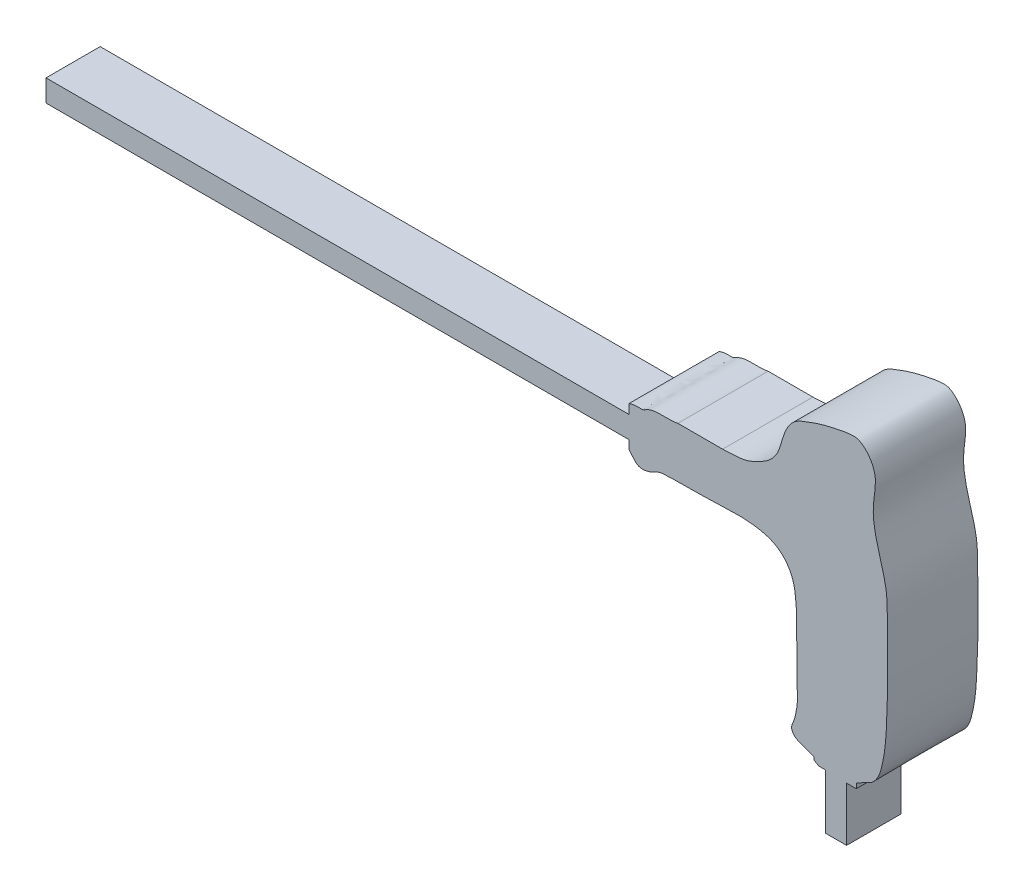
from build123d import *

# Parameters (mm, degrees)
BOSS_EXTRU_1_DEPTH      = 10
BOSS_EXTRU_1_DEPTH_BACK = 10
ESQUISSE2_W             = 4.650975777
ESQUISSE2_H             = 11.951241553
ESQUISSE2_W_2           = 129.179899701
ESQUISSE2_H_2           = 4.838027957
ENL_V_MAT_EXTRU_1_DEPTH = 8


with BuildPart() as part:
    # Esquisse1 → Boss.-Extru.1 (new, two sides: drawn at the far end of the back side and taken through both)
    with BuildSketch(Plane.XY.offset(-BOSS_EXTRU_1_DEPTH_BACK)):
        with BuildLine():
            Line((200.326850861, 127.469215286), (71.14695116, 127.469215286))
            Line((71.14695116, 127.469215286), (71.14695116, 122.631187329))
            Line((71.14695116, 122.631187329), (200.326850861, 122.631187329))
            Line((200.326850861, 122.631187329), (200.326850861, 120.780955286))
            add(Edge.make_bspline(
                [(200.326850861, 120.780955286), (200.976403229, 120.118576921), (201.790471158, 118.498355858), (203.57159299, 118.445839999), (204.776091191, 118.654219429), (205.922609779, 119.2122944), (207.448152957, 119.971812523), (208.767127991, 119.848146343), (209.962572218, 119.964572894), (211.057221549, 119.954960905), (213.076805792, 119.993248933), (215.82704311, 119.99950571), (218.903257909, 120.085876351), (221.801662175, 120.185317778), (224.392229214, 120.321512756), (226.841122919, 120.172470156), (229.371234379, 119.900831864), (231.753046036, 119.250177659), (234.550302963, 117.638497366), (236.538386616, 114.838754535), (237.427403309, 110.49328546), (237.477582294, 105.640384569), (237.490623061, 99.951484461), (237.541604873, 94.875564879), (237.752640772, 91.123889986), (237.332269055, 88.69612375), (236.973036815, 87.139785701), (236.375375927, 85.999935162), (236.316166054, 85.027639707), (237.00631938, 83.904164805), (238.872882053, 83.093864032), (240.433411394, 82.644375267), (241.362331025, 82.310713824)],
                knots=[0, 0, 0, 0, 0.041719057, 0.056995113, 0.067757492, 0.0907017, 0.10765282, 0.134914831, 0.141748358, 0.155798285, 0.178637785, 0.222641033, 0.265843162, 0.301798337, 0.33874171, 0.369558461, 0.399857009, 0.440590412, 0.467229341, 0.527997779, 0.570154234, 0.6434881, 0.721730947, 0.797897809, 0.84701082, 0.871143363, 0.896379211, 0.910442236, 0.922365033, 0.933353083, 0.960883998, 1, 1, 1, 1], degree=3))
            Line((241.362331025, 82.310713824), (241.362331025, 81.597670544))
            Line((241.362331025, 81.597670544), (242.392308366, 81.023611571))
            Line((242.392308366, 81.023611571), (243.892148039, 81.023611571))
            Line((243.892148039, 81.023611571), (243.892148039, 68.881078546))
            Line((243.892148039, 68.881078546), (248.543123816, 68.881078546))
            Line((248.543123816, 68.881078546), (248.543123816, 80.832320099))
            Line((248.543123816, 80.832320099), (250.691992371, 80.832320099))
            Line((250.691992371, 80.832320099), (250.691992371, 81.954192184))
            Line((250.691992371, 81.954192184), (253.959450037, 83.658229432))
            add(Edge.make_bspline(
                [(253.959450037, 83.658229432), (255.41368155, 84.692292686), (256.309889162, 87.398142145), (257.160439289, 92.041444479), (257.489936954, 97.806951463), (257.740569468, 106.695670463), (257.629973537, 115.016264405), (257.507672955, 121.950014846), (256.412860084, 126.329435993), (255.268117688, 130.057147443), (254.587312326, 133.489662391), (254.291883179, 136.786594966), (254.855353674, 139.753661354), (254.964170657, 142.332617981), (254.602684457, 144.386360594), (253.368907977, 146.515906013), (251.31276775, 148.275219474), (249.073245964, 148.206115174), (246.675452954, 147.760865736), (243.298543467, 147.029921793), (239.860743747, 145.872385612), (236.767514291, 144.537003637), (235.064921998, 142.087752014), (234.190435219, 139.400971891), (233.410607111, 136.496224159), (231.543851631, 134.134279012), (229.032596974, 132.75934063), (225.671749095, 131.13709351), (222.852034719, 131.354890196), (221.073684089, 131.182219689)],
                knots=[0, 0, 0, 0, 0.048462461, 0.078889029, 0.136163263, 0.213713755, 0.334449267, 0.375532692, 0.412085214, 0.463525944, 0.487574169, 0.512536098, 0.558031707, 0.573645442, 0.586449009, 0.61732486, 0.64335573, 0.658312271, 0.679608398, 0.713953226, 0.756990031, 0.78465188, 0.80807479, 0.839786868, 0.865879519, 0.893817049, 0.92316661, 0.947560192, 1, 1, 1, 1], degree=3))
            Line((221.073684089, 131.182219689), (211.155897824, 131.182219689))
            add(Edge.make_bspline(
                [(211.155897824, 131.182219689), (208.979704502, 130.6787125), (205.927795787, 131.591395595), (203.484426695, 129.856707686), (202.113381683, 129.945278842), (201.118709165, 129.844045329), (200.326850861, 129.565005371)],
                knots=[0, 0, 0, 0, 0.636596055, 0.720634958, 0.778990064, 1, 1, 1, 1], degree=3))
            Line((200.326850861, 129.565005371), (200.326850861, 127.469215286))
        make_face()
    extrude(amount=BOSS_EXTRU_1_DEPTH + BOSS_EXTRU_1_DEPTH_BACK)

    # Esquisse2 → Enl_v. mat.-Extru.1 (cut)
    with BuildSketch(Plane(origin=(0, 0, -10), x_dir=(-1, 0, 0), z_dir=(0, 0, -1))):
        with Locations((-246.217635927, 74.856699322)):
            Rectangle(ESQUISSE2_W, ESQUISSE2_H)
        with Locations((-135.736901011, 125.050201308)):
            Rectangle(ESQUISSE2_W_2, ESQUISSE2_H_2)
    extrude(amount=-ENL_V_MAT_EXTRU_1_DEPTH, mode=Mode.SUBTRACT)


solid = part.part
